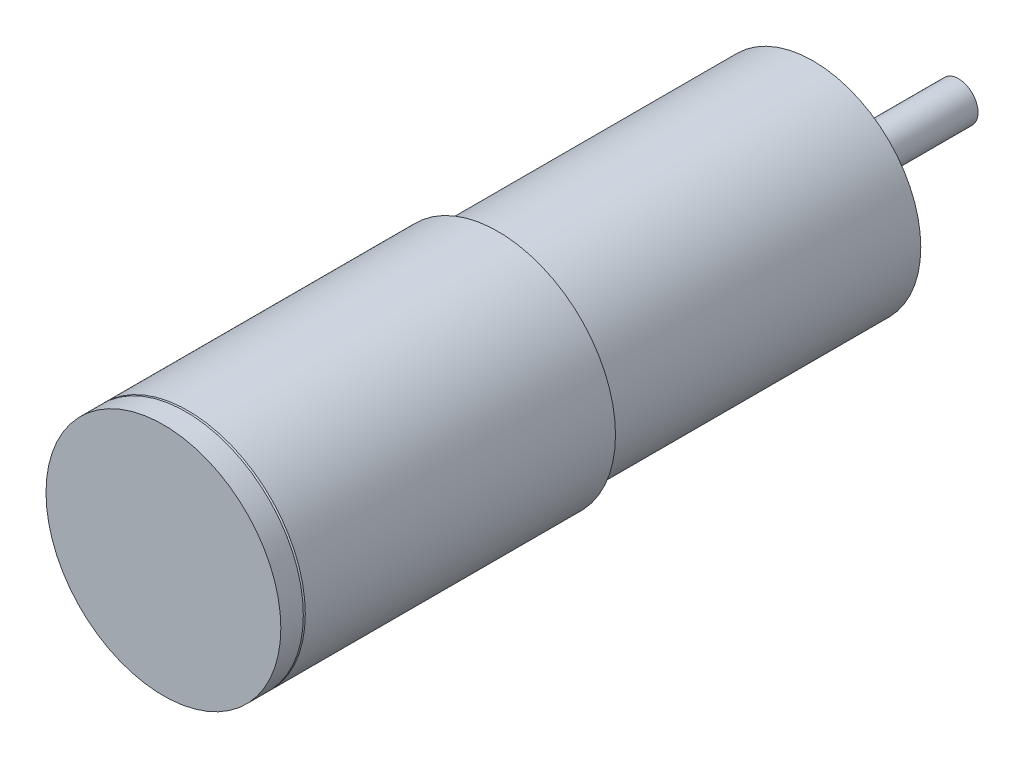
ISO-10303-21;
HEADER;
FILE_DESCRIPTION(('STEP AP214'),'2;1');
FILE_NAME('part.step','',(''),(''),'','','');
FILE_SCHEMA(('AUTOMOTIVE_DESIGN { 1 0 10303 214 1 1 1 1 }'));
ENDSEC;
DATA;
#1=APPLICATION_CONTEXT('core data for automotive mechanical design processes');
#2=APPLICATION_PROTOCOL_DEFINITION('international standard','automotive_design',2000,#1);
#3=PRODUCT_CONTEXT('',#1,'mechanical');
#4=PRODUCT('Part','Part','',(#3));
#5=PRODUCT_RELATED_PRODUCT_CATEGORY('part','',(#4));
#6=PRODUCT_DEFINITION_FORMATION('','',#4);
#7=PRODUCT_DEFINITION_CONTEXT('part definition',#1,'design');
#8=PRODUCT_DEFINITION('design','',#6,#7);
#9=PRODUCT_DEFINITION_SHAPE('','',#8);
#10=(LENGTH_UNIT() NAMED_UNIT(*) SI_UNIT(.MILLI.,.METRE.));
#11=(NAMED_UNIT(*) PLANE_ANGLE_UNIT() SI_UNIT($,.RADIAN.));
#12=(NAMED_UNIT(*) SI_UNIT($,.STERADIAN.) SOLID_ANGLE_UNIT());
#13=UNCERTAINTY_MEASURE_WITH_UNIT(LENGTH_MEASURE(1.E-05),#10,'distance_accuracy_value','');
#14=(GEOMETRIC_REPRESENTATION_CONTEXT(3) GLOBAL_UNCERTAINTY_ASSIGNED_CONTEXT((#13)) GLOBAL_UNIT_ASSIGNED_CONTEXT((#10,
#11,#12)) REPRESENTATION_CONTEXT('',''));
#15=CARTESIAN_POINT('',(0.,0.,0.));
#16=DIRECTION('',(0.,0.,1.));
#17=DIRECTION('',(1.,0.,0.));
#18=AXIS2_PLACEMENT_3D('',#15,#16,#17);
#19=CARTESIAN_POINT('',(0.,0.,-3.15));
#20=DIRECTION('',(0.,0.,1.));
#21=DIRECTION('',(1.,0.,0.));
#22=AXIS2_PLACEMENT_3D('',#19,#20,#21);
#23=CYLINDRICAL_SURFACE('',#22,5.);
#24=CARTESIAN_POINT('',(0.,0.,0.));
#25=DIRECTION('',(0.,0.,1.));
#26=DIRECTION('',(1.,0.,0.));
#27=AXIS2_PLACEMENT_3D('',#24,#25,#26);
#28=CIRCLE('',#27,5.);
#29=CARTESIAN_POINT('',(5.,0.,0.));
#30=VERTEX_POINT('',#29);
#31=EDGE_CURVE('E38',#30,#30,#28,.F.);
#32=ORIENTED_EDGE('',*,*,#31,.T.);
#33=EDGE_LOOP('',(#32));
#34=FACE_BOUND('',#33,.T.);
#35=CARTESIAN_POINT('',(0.,0.,-1.35));
#36=DIRECTION('',(0.,0.,-1.));
#37=DIRECTION('',(-1.,0.,0.));
#38=AXIS2_PLACEMENT_3D('',#35,#36,#37);
#39=CIRCLE('',#38,5.);
#40=CARTESIAN_POINT('',(-5.,0.,-1.35));
#41=VERTEX_POINT('',#40);
#42=EDGE_CURVE('E30',#41,#41,#39,.T.);
#43=ORIENTED_EDGE('',*,*,#42,.F.);
#44=EDGE_LOOP('',(#43));
#45=FACE_BOUND('',#44,.T.);
#46=ADVANCED_FACE('F26',(#34,#45),#23,.T.);
#47=CARTESIAN_POINT('',(0.,0.,0.));
#48=DIRECTION('',(0.,0.,1.));
#49=DIRECTION('',(1.,0.,0.));
#50=AXIS2_PLACEMENT_3D('',#47,#48,#49);
#51=PLANE('',#50);
#52=CARTESIAN_POINT('',(0.,0.,0.));
#53=DIRECTION('',(0.,0.,1.));
#54=DIRECTION('',(1.,0.,0.));
#55=AXIS2_PLACEMENT_3D('',#52,#53,#54);
#56=CIRCLE('',#55,11.);
#57=CARTESIAN_POINT('',(11.,0.,0.));
#58=VERTEX_POINT('',#57);
#59=EDGE_CURVE('E54',#58,#58,#56,.T.);
#60=ORIENTED_EDGE('',*,*,#59,.F.);
#61=EDGE_LOOP('',(#60));
#62=FACE_BOUND('',#61,.T.);
#63=ORIENTED_EDGE('',*,*,#31,.F.);
#64=EDGE_LOOP('',(#63));
#65=FACE_BOUND('',#64,.T.);
#66=ADVANCED_FACE('F93',(#62,#65),#51,.F.);
#67=CARTESIAN_POINT('',(0.,0.,32.2));
#68=DIRECTION('',(0.,0.,-1.));
#69=DIRECTION('',(-1.,0.,0.));
#70=AXIS2_PLACEMENT_3D('',#67,#68,#69);
#71=CYLINDRICAL_SURFACE('',#70,11.);
#72=CARTESIAN_POINT('',(0.,0.,31.819));
#73=DIRECTION('',(0.,0.,1.));
#74=DIRECTION('',(1.,0.,0.));
#75=AXIS2_PLACEMENT_3D('',#72,#73,#74);
#76=CIRCLE('',#75,11.);
#77=CARTESIAN_POINT('',(11.,0.,31.819));
#78=VERTEX_POINT('',#77);
#79=EDGE_CURVE('E48',#78,#78,#76,.F.);
#80=ORIENTED_EDGE('',*,*,#79,.T.);
#81=EDGE_LOOP('',(#80));
#82=FACE_BOUND('',#81,.T.);
#83=ORIENTED_EDGE('',*,*,#59,.T.);
#84=EDGE_LOOP('',(#83));
#85=FACE_BOUND('',#84,.T.);
#86=ADVANCED_FACE('F28',(#82,#85),#71,.T.);
#87=CARTESIAN_POINT('',(0.,0.,32.2));
#88=DIRECTION('',(0.,0.,-1.));
#89=DIRECTION('',(-1.,0.,0.));
#90=AXIS2_PLACEMENT_3D('',#87,#88,#89);
#91=CONICAL_SURFACE('',#90,10.619,0.785398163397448);
#92=ORIENTED_EDGE('',*,*,#79,.F.);
#93=EDGE_LOOP('',(#92));
#94=FACE_BOUND('',#93,.T.);
#95=CARTESIAN_POINT('',(0.,0.,32.2));
#96=DIRECTION('',(0.,0.,1.));
#97=DIRECTION('',(1.,0.,0.));
#98=AXIS2_PLACEMENT_3D('',#95,#96,#97);
#99=CIRCLE('',#98,10.619);
#100=CARTESIAN_POINT('',(10.619,0.,32.2));
#101=VERTEX_POINT('',#100);
#102=EDGE_CURVE('E51',#101,#101,#99,.T.);
#103=ORIENTED_EDGE('',*,*,#102,.F.);
#104=EDGE_LOOP('',(#103));
#105=FACE_BOUND('',#104,.T.);
#106=ADVANCED_FACE('F112',(#94,#105),#91,.T.);
#107=CARTESIAN_POINT('',(0.,0.,64.1));
#108=DIRECTION('',(0.,0.,-1.));
#109=DIRECTION('',(-1.,0.,0.));
#110=AXIS2_PLACEMENT_3D('',#107,#108,#109);
#111=CYLINDRICAL_SURFACE('',#110,12.);
#112=CARTESIAN_POINT('',(0.,0.,63.9));
#113=DIRECTION('',(0.,0.,1.));
#114=DIRECTION('',(1.,0.,0.));
#115=AXIS2_PLACEMENT_3D('',#112,#113,#114);
#116=CIRCLE('',#115,12.);
#117=CARTESIAN_POINT('',(12.,0.,63.9));
#118=VERTEX_POINT('',#117);
#119=EDGE_CURVE('E10',#118,#118,#116,.F.);
#120=ORIENTED_EDGE('',*,*,#119,.T.);
#121=EDGE_LOOP('',(#120));
#122=FACE_BOUND('',#121,.T.);
#123=CARTESIAN_POINT('',(0.,0.,32.2));
#124=DIRECTION('',(0.,0.,1.));
#125=DIRECTION('',(1.,0.,0.));
#126=AXIS2_PLACEMENT_3D('',#123,#124,#125);
#127=CIRCLE('',#126,12.);
#128=CARTESIAN_POINT('',(12.,0.,32.2));
#129=VERTEX_POINT('',#128);
#130=EDGE_CURVE('E44',#129,#129,#127,.T.);
#131=ORIENTED_EDGE('',*,*,#130,.T.);
#132=EDGE_LOOP('',(#131));
#133=FACE_BOUND('',#132,.T.);
#134=ADVANCED_FACE('F108',(#122,#133),#111,.T.);
#135=CARTESIAN_POINT('',(0.,0.,32.2));
#136=DIRECTION('',(0.,0.,1.));
#137=DIRECTION('',(1.,0.,0.));
#138=AXIS2_PLACEMENT_3D('',#135,#136,#137);
#139=PLANE('',#138);
#140=ORIENTED_EDGE('',*,*,#102,.T.);
#141=EDGE_LOOP('',(#140));
#142=FACE_BOUND('',#141,.T.);
#143=ORIENTED_EDGE('',*,*,#130,.F.);
#144=EDGE_LOOP('',(#143));
#145=FACE_BOUND('',#144,.T.);
#146=ADVANCED_FACE('F104',(#142,#145),#139,.F.);
#147=CARTESIAN_POINT('',(0.,0.,64.1));
#148=DIRECTION('',(0.,0.,-1.));
#149=DIRECTION('',(-1.,0.,0.));
#150=AXIS2_PLACEMENT_3D('',#147,#148,#149);
#151=CONICAL_SURFACE('',#150,11.8,0.78539816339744);
#152=ORIENTED_EDGE('',*,*,#119,.F.);
#153=EDGE_LOOP('',(#152));
#154=FACE_BOUND('',#153,.T.);
#155=CARTESIAN_POINT('',(0.,0.,64.1));
#156=DIRECTION('',(0.,0.,1.));
#157=DIRECTION('',(1.,0.,0.));
#158=AXIS2_PLACEMENT_3D('',#155,#156,#157);
#159=CIRCLE('',#158,11.8);
#160=CARTESIAN_POINT('',(11.8,0.,64.1));
#161=VERTEX_POINT('',#160);
#162=EDGE_CURVE('E34',#161,#161,#159,.T.);
#163=ORIENTED_EDGE('',*,*,#162,.F.);
#164=EDGE_LOOP('',(#163));
#165=FACE_BOUND('',#164,.T.);
#166=ADVANCED_FACE('F107',(#154,#165),#151,.T.);
#167=CARTESIAN_POINT('',(0.,0.,66.4));
#168=DIRECTION('',(0.,0.,-1.));
#169=DIRECTION('',(-1.,0.,0.));
#170=AXIS2_PLACEMENT_3D('',#167,#168,#169);
#171=CYLINDRICAL_SURFACE('',#170,12.);
#172=CARTESIAN_POINT('',(0.,0.,66.4));
#173=DIRECTION('',(0.,0.,1.));
#174=DIRECTION('',(1.,0.,0.));
#175=AXIS2_PLACEMENT_3D('',#172,#173,#174);
#176=CIRCLE('',#175,12.);
#177=CARTESIAN_POINT('',(12.,0.,66.4));
#178=VERTEX_POINT('',#177);
#179=EDGE_CURVE('E61',#178,#178,#176,.T.);
#180=ORIENTED_EDGE('',*,*,#179,.F.);
#181=EDGE_LOOP('',(#180));
#182=FACE_BOUND('',#181,.T.);
#183=CARTESIAN_POINT('',(0.,0.,64.1));
#184=DIRECTION('',(0.,0.,1.));
#185=DIRECTION('',(1.,0.,0.));
#186=AXIS2_PLACEMENT_3D('',#183,#184,#185);
#187=CIRCLE('',#186,12.);
#188=CARTESIAN_POINT('',(12.,0.,64.1));
#189=VERTEX_POINT('',#188);
#190=EDGE_CURVE('E64',#189,#189,#187,.T.);
#191=ORIENTED_EDGE('',*,*,#190,.T.);
#192=EDGE_LOOP('',(#191));
#193=FACE_BOUND('',#192,.T.);
#194=ADVANCED_FACE('F169',(#182,#193),#171,.T.);
#195=CARTESIAN_POINT('',(0.,0.,66.4));
#196=DIRECTION('',(0.,0.,1.));
#197=DIRECTION('',(1.,0.,0.));
#198=AXIS2_PLACEMENT_3D('',#195,#196,#197);
#199=PLANE('',#198);
#200=ORIENTED_EDGE('',*,*,#179,.T.);
#201=EDGE_LOOP('',(#200));
#202=FACE_BOUND('',#201,.T.);
#203=ADVANCED_FACE('F179',(#202),#199,.T.);
#204=CARTESIAN_POINT('',(0.,0.,64.1));
#205=DIRECTION('',(0.,0.,1.));
#206=DIRECTION('',(1.,0.,0.));
#207=AXIS2_PLACEMENT_3D('',#204,#205,#206);
#208=PLANE('',#207);
#209=ORIENTED_EDGE('',*,*,#162,.T.);
#210=EDGE_LOOP('',(#209));
#211=FACE_BOUND('',#210,.T.);
#212=ORIENTED_EDGE('',*,*,#190,.F.);
#213=EDGE_LOOP('',(#212));
#214=FACE_BOUND('',#213,.T.);
#215=ADVANCED_FACE('F89',(#211,#214),#208,.F.);
#216=CARTESIAN_POINT('',(0.,0.,-1.35));
#217=DIRECTION('',(0.,0.,-1.));
#218=DIRECTION('',(-1.,0.,0.));
#219=AXIS2_PLACEMENT_3D('',#216,#217,#218);
#220=PLANE('',#219);
#221=CARTESIAN_POINT('',(0.,0.,-1.35));
#222=DIRECTION('',(0.,0.,-1.));
#223=DIRECTION('',(-1.,0.,0.));
#224=AXIS2_PLACEMENT_3D('',#221,#222,#223);
#225=CIRCLE('',#224,3.5);
#226=CARTESIAN_POINT('',(-3.5,0.,-1.35));
#227=VERTEX_POINT('',#226);
#228=EDGE_CURVE('E67',#227,#227,#225,.T.);
#229=ORIENTED_EDGE('',*,*,#228,.F.);
#230=EDGE_LOOP('',(#229));
#231=FACE_BOUND('',#230,.T.);
#232=ORIENTED_EDGE('',*,*,#42,.T.);
#233=EDGE_LOOP('',(#232));
#234=FACE_BOUND('',#233,.T.);
#235=ADVANCED_FACE('F79',(#231,#234),#220,.T.);
#236=CARTESIAN_POINT('',(0.,0.,-1.35));
#237=DIRECTION('',(0.,0.,-1.));
#238=DIRECTION('',(-1.,0.,0.));
#239=AXIS2_PLACEMENT_3D('',#236,#237,#238);
#240=CYLINDRICAL_SURFACE('',#239,3.5);
#241=ORIENTED_EDGE('',*,*,#228,.T.);
#242=EDGE_LOOP('',(#241));
#243=FACE_BOUND('',#242,.T.);
#244=CARTESIAN_POINT('',(0.,0.,-3.15));
#245=DIRECTION('',(0.,0.,-1.));
#246=DIRECTION('',(-1.,0.,0.));
#247=AXIS2_PLACEMENT_3D('',#244,#245,#246);
#248=CIRCLE('',#247,3.5);
#249=CARTESIAN_POINT('',(-3.5,0.,-3.15));
#250=VERTEX_POINT('',#249);
#251=EDGE_CURVE('E70',#250,#250,#248,.T.);
#252=ORIENTED_EDGE('',*,*,#251,.F.);
#253=EDGE_LOOP('',(#252));
#254=FACE_BOUND('',#253,.T.);
#255=ADVANCED_FACE('F76',(#243,#254),#240,.T.);
#256=CARTESIAN_POINT('',(0.,0.,-14.85));
#257=DIRECTION('',(0.,0.,-1.));
#258=DIRECTION('',(-1.,0.,0.));
#259=AXIS2_PLACEMENT_3D('',#256,#257,#258);
#260=PLANE('',#259);
#261=CARTESIAN_POINT('',(0.,0.,-14.85));
#262=DIRECTION('',(0.,0.,-1.));
#263=DIRECTION('',(-1.,0.,0.));
#264=AXIS2_PLACEMENT_3D('',#261,#262,#263);
#265=CIRCLE('',#264,2.);
#266=CARTESIAN_POINT('',(-2.,0.,-14.85));
#267=VERTEX_POINT('',#266);
#268=EDGE_CURVE('E45',#267,#267,#265,.T.);
#269=ORIENTED_EDGE('',*,*,#268,.T.);
#270=EDGE_LOOP('',(#269));
#271=FACE_BOUND('',#270,.T.);
#272=ADVANCED_FACE('F78',(#271),#260,.T.);
#273=CARTESIAN_POINT('',(0.,0.,-14.85));
#274=DIRECTION('',(0.,0.,1.));
#275=DIRECTION('',(1.,0.,0.));
#276=AXIS2_PLACEMENT_3D('',#273,#274,#275);
#277=CYLINDRICAL_SURFACE('',#276,2.);
#278=CARTESIAN_POINT('',(0.,0.,-3.15));
#279=DIRECTION('',(0.,0.,-1.));
#280=DIRECTION('',(-1.,0.,0.));
#281=AXIS2_PLACEMENT_3D('',#278,#279,#280);
#282=CIRCLE('',#281,2.);
#283=CARTESIAN_POINT('',(-2.,0.,-3.15));
#284=VERTEX_POINT('',#283);
#285=EDGE_CURVE('E41',#284,#284,#282,.F.);
#286=ORIENTED_EDGE('',*,*,#285,.F.);
#287=EDGE_LOOP('',(#286));
#288=FACE_BOUND('',#287,.T.);
#289=ORIENTED_EDGE('',*,*,#268,.F.);
#290=EDGE_LOOP('',(#289));
#291=FACE_BOUND('',#290,.T.);
#292=ADVANCED_FACE('F86',(#288,#291),#277,.T.);
#293=CARTESIAN_POINT('',(0.,0.,-3.15));
#294=DIRECTION('',(0.,0.,-1.));
#295=DIRECTION('',(-1.,0.,0.));
#296=AXIS2_PLACEMENT_3D('',#293,#294,#295);
#297=PLANE('',#296);
#298=ORIENTED_EDGE('',*,*,#285,.T.);
#299=EDGE_LOOP('',(#298));
#300=FACE_BOUND('',#299,.T.);
#301=ORIENTED_EDGE('',*,*,#251,.T.);
#302=EDGE_LOOP('',(#301));
#303=FACE_BOUND('',#302,.T.);
#304=ADVANCED_FACE('F74',(#300,#303),#297,.T.);
#305=CLOSED_SHELL('',(#46,#66,#86,#106,#134,#146,#166,#194,#203,#215,#235,#255,#272,#292,#304));
#306=MANIFOLD_SOLID_BREP('B2',#305);
#307=ADVANCED_BREP_SHAPE_REPRESENTATION('',(#18,#306),#14);
#308=SHAPE_DEFINITION_REPRESENTATION(#9,#307);
ENDSEC;
END-ISO-10303-21;
